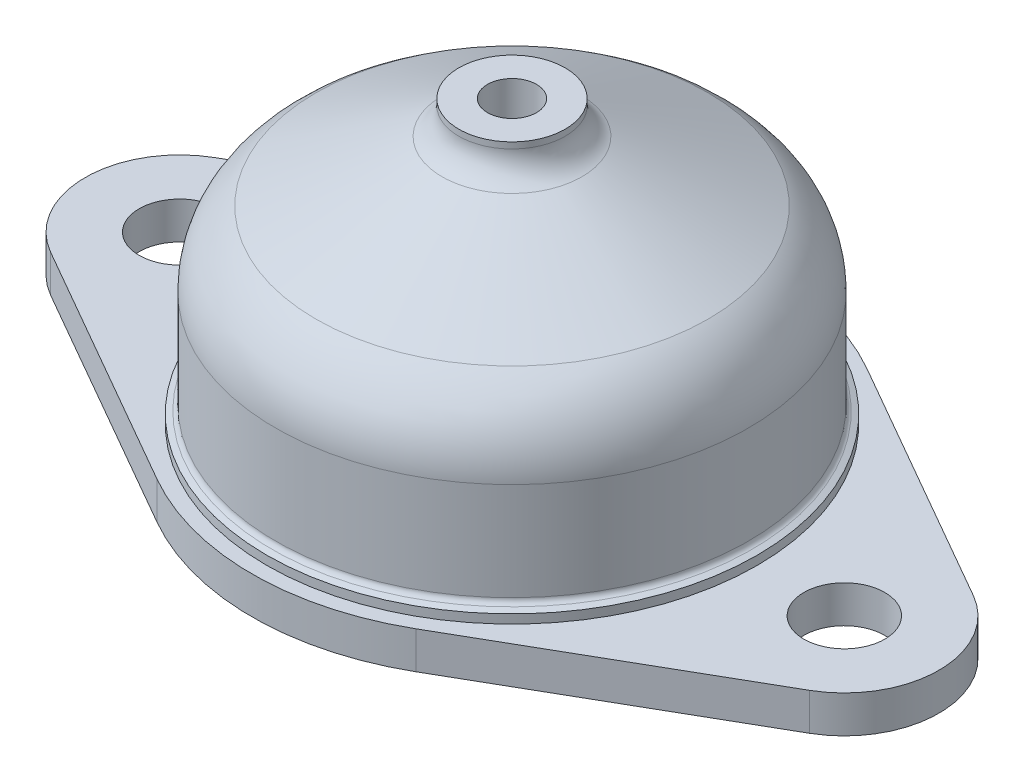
from build123d import *

# Parameters (mm, degrees)
SKETCH1_R          = 1.7399
BASE_EXTRUDE_DEPTH = 1.6002
SKETCH3_R          = 8.429238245
CUT_EXTRUDE1_DEPTH = 1.6002


with BuildPart() as part:
    # Sketch1 → Base-Extrude (new body)
    with BuildSketch(Plane(origin=(0, 0, 0), x_dir=(1, 0, 0), z_dir=(0, 1, 0))):
        with BuildLine():
            Line((-16.310468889, 3.524725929), (-5.563164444, 9.692996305))
            ThreePointArc((-5.563164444, 9.692996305), (0, 11.176), (5.563164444, 9.692996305))
            Line((5.563164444, 9.692996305), (16.310468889, 3.524725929))
            ThreePointArc((16.310468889, 3.524725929), (18.3515, 0), (16.310468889, -3.524725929))
            Line((16.310468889, -3.524725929), (5.563164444, -9.692996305))
            ThreePointArc((5.563164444, -9.692996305), (0, -11.176), (-5.563164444, -9.692996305))
            Line((-5.563164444, -9.692996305), (-16.310468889, -3.524725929))
            ThreePointArc((-16.310468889, -3.524725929), (-18.3515, 0), (-16.310468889, 3.524725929))
        make_face()
        with Locations(Location((-14.2875, 0, 0), (0, 0, 270))):
            Circle(SKETCH1_R, mode=Mode.SUBTRACT)
        with Locations(Location((14.2875, 0, 0), (0, 0, 270))):
            Circle(SKETCH1_R, mode=Mode.SUBTRACT)
    extrude(amount=BASE_EXTRUDE_DEPTH)

    # Sketch2 → Boss-Revolve1 (revolve)
    with BuildSketch(Plane.XY, mode=Mode.PRIVATE) as boss_revolve1_sk:
        with BuildLine():
            Line((7.147916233, 1.6002), (7.147916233, 3.860044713))
            ThreePointArc((7.147916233, 3.860044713), (6.90230418, 4.828467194), (6.224843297, 5.56277921))
            Line((6.224843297, 5.56277921), (2.286, 8.128))
            Line((2.286, 8.128), (1.0541, 8.128))
            Line((1.0541, 8.128), (1.0541, 13.716))
            Line((1.0541, 13.716), (2.286, 13.716))
            Line((2.286, 13.716), (2.286, 13.451993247))
            ThreePointArc((2.286, 13.451993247), (2.481652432, 12.774736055), (3.008326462, 12.306151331))
            Line((3.008326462, 12.306151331), (8.429238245, 9.715139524))
            ThreePointArc((8.429238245, 9.715139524), (9.6994774, 8.338304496), (10.16, 6.522512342))
            Line((10.16, 6.522512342), (10.16, 2.314026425))
            ThreePointArc((10.16, 2.314026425), (10.201421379, 2.175007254), (10.312175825, 2.081329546))
            Line((10.312175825, 2.081329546), (10.541, 1.9812))
            Line((10.541, 1.9812), (10.541, 1.6002))
            Line((10.541, 1.6002), (7.147916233, 1.6002))
        make_face()
    revolve(boss_revolve1_sk.sketch.rotate(Axis((0, -0.202291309, 0), (0, 1, 0)), 90), axis=Axis((0, -0.202291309, 0), (0, 1, 0)))

    # Sketch3 → Cut-Extrude1 (cut)
    with BuildSketch(Plane.XZ):
        with Locations(Location((0, 0, 0), (0, 0, 270))):
            Circle(SKETCH3_R)
    extrude(amount=-CUT_EXTRUDE1_DEPTH, mode=Mode.SUBTRACT)


solid = part.part
